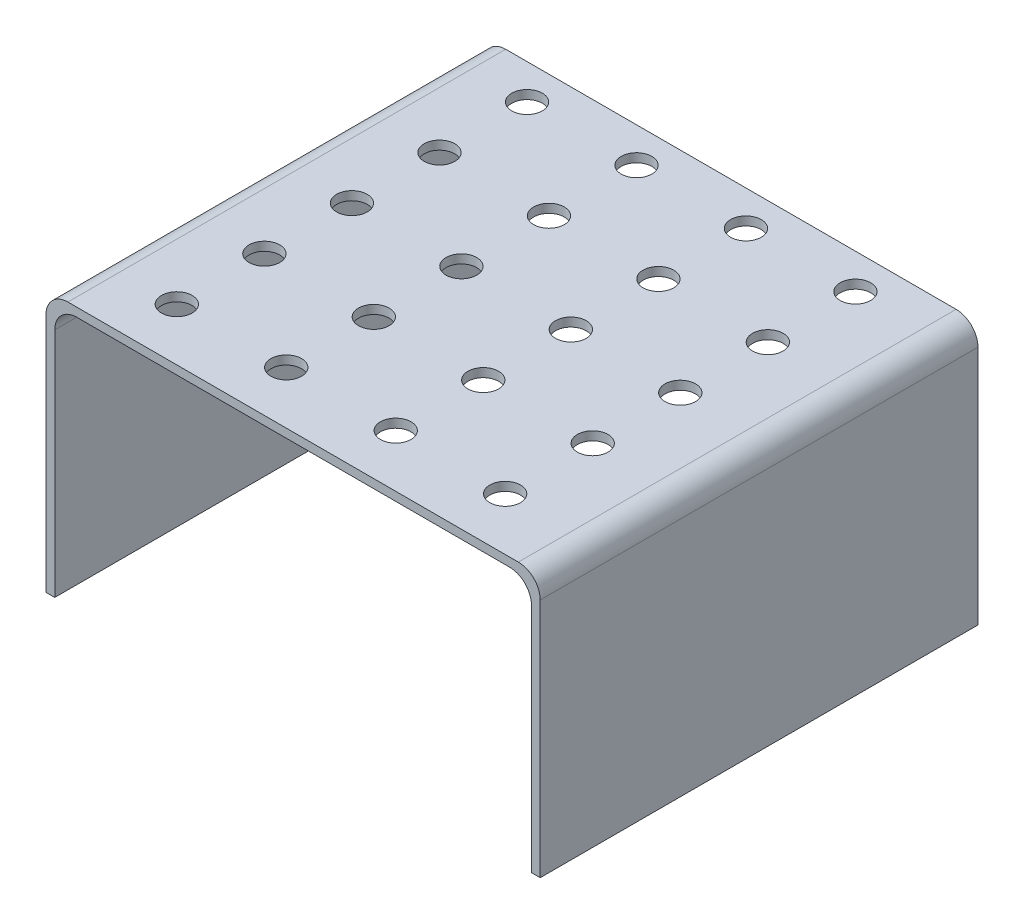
from build123d import *

# Parameters (mm, degrees)
EXTRUSION1_DEPTH                = 100
CONG_1_R                        = 5
ESQUISSE3_R                     = 3.5
ENL_V_MAT_EXTRU_1_DEPTH         = 137.258437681
R_P_TITION_LIN_AIRE1_COUNT      = 4
R_P_TITION_LIN_AIRE1_PITCH      = 25
R_P_TITION_LIN_AIRE1_COUNT_DIR2 = 5
R_P_TITION_LIN_AIRE1_PITCH_DIR2 = 20


with BuildPart() as part:
    # Esquisse2 → Extrusion1 (new body)
    with BuildSketch(Plane.XY):
        Polygon((-42.35553685, -30.402413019), (-40.35553685, -30.402413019), (-40.35553685, 27.538645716), (68.522558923, 27.538645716), (68.522558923, -30.402413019), (70.522558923, -30.402413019), (70.522558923, 29.538645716), (-42.35553685, 29.538645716), align=None)
    extrude(amount=EXTRUSION1_DEPTH)

    # Cong_1
    cong_1_edges = [part.edges().sort_by_distance(p)[0] for p in [
        (-42.35553685, 29.538645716, 50),
        (70.522558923, 29.538645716, 50),
        (68.522558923, 27.538645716, 50),
        (-40.35553685, 27.538645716, 50),
    ]]
    fillet(cong_1_edges, radius=CONG_1_R)

    # Esquisse3 → Enl_v. mat.-Extru.1 (cut, through all)
    with BuildSketch(Plane(origin=(0, 29.538645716, 0), x_dir=(-1, 0, 0), z_dir=(0, 1, 0))):
        with Locations((-50.522558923, 88)):
            Circle(ESQUISSE3_R)
    enl_v_mat_extru_1 = extrude(amount=-ENL_V_MAT_EXTRU_1_DEPTH, mode=Mode.SUBTRACT)

    # R_p_tition lin_aire1: Enl_v. mat.-Extru.1 4 × 5
    with Locations(*[(-i * R_P_TITION_LIN_AIRE1_PITCH, 0, -j * R_P_TITION_LIN_AIRE1_PITCH_DIR2) for i in range(R_P_TITION_LIN_AIRE1_COUNT) for j in range(R_P_TITION_LIN_AIRE1_COUNT_DIR2) if (i, j) != (0, 0)]):
        add(enl_v_mat_extru_1, mode=Mode.SUBTRACT)


solid = part.part
